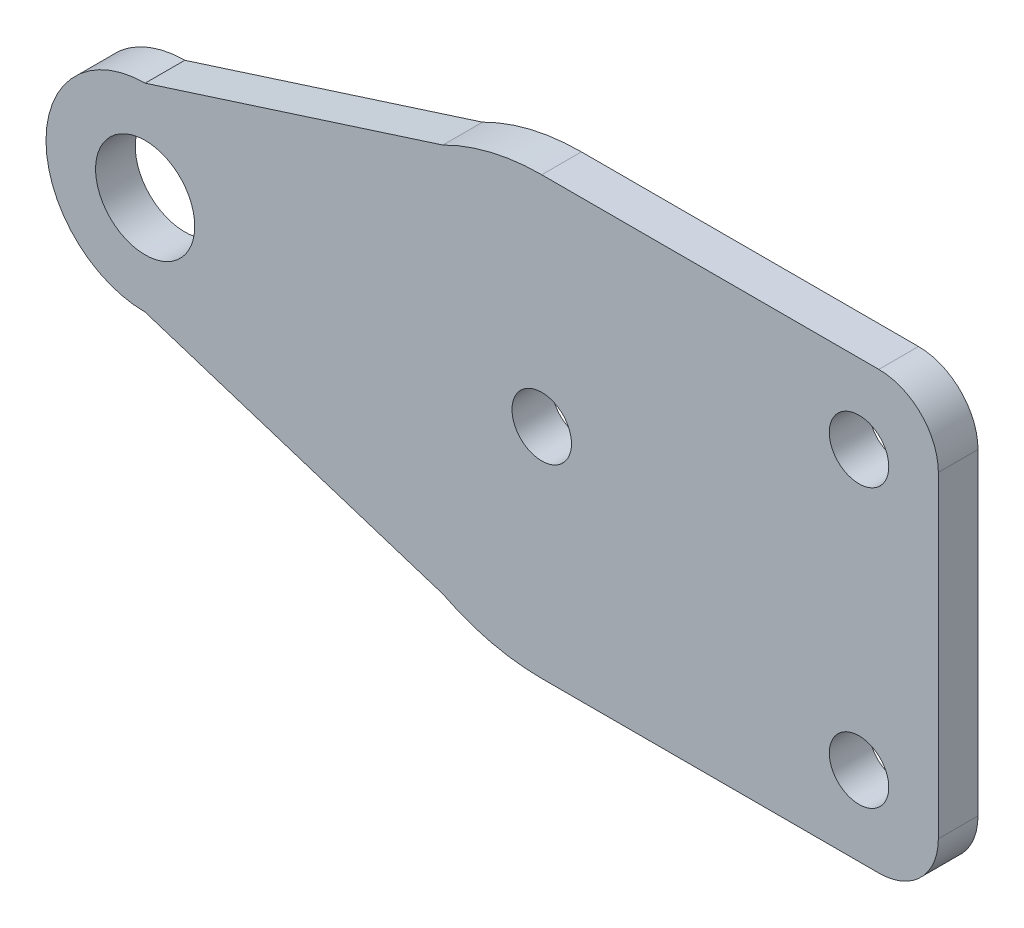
ISO-10303-21;
HEADER;
FILE_DESCRIPTION(('STEP AP214'),'2;1');
FILE_NAME('part.step','',(''),(''),'','','');
FILE_SCHEMA(('AUTOMOTIVE_DESIGN { 1 0 10303 214 1 1 1 1 }'));
ENDSEC;
DATA;
#1=APPLICATION_CONTEXT('core data for automotive mechanical design processes');
#2=APPLICATION_PROTOCOL_DEFINITION('international standard','automotive_design',2000,#1);
#3=PRODUCT_CONTEXT('',#1,'mechanical');
#4=PRODUCT('Part','Part','',(#3));
#5=PRODUCT_RELATED_PRODUCT_CATEGORY('part','',(#4));
#6=PRODUCT_DEFINITION_FORMATION('','',#4);
#7=PRODUCT_DEFINITION_CONTEXT('part definition',#1,'design');
#8=PRODUCT_DEFINITION('design','',#6,#7);
#9=PRODUCT_DEFINITION_SHAPE('','',#8);
#10=(LENGTH_UNIT() NAMED_UNIT(*) SI_UNIT(.MILLI.,.METRE.));
#11=(NAMED_UNIT(*) PLANE_ANGLE_UNIT() SI_UNIT($,.RADIAN.));
#12=(NAMED_UNIT(*) SI_UNIT($,.STERADIAN.) SOLID_ANGLE_UNIT());
#13=UNCERTAINTY_MEASURE_WITH_UNIT(LENGTH_MEASURE(1.E-05),#10,'distance_accuracy_value','');
#14=(GEOMETRIC_REPRESENTATION_CONTEXT(3) GLOBAL_UNCERTAINTY_ASSIGNED_CONTEXT((#13)) GLOBAL_UNIT_ASSIGNED_CONTEXT((#10,
#11,#12)) REPRESENTATION_CONTEXT('',''));
#15=CARTESIAN_POINT('',(0.,0.,0.));
#16=DIRECTION('',(0.,0.,1.));
#17=DIRECTION('',(1.,0.,0.));
#18=AXIS2_PLACEMENT_3D('',#15,#16,#17);
#19=CARTESIAN_POINT('',(0.,-2.72351585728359E-13,2.));
#20=DIRECTION('',(0.,0.,-1.));
#21=DIRECTION('',(-1.,0.,0.));
#22=AXIS2_PLACEMENT_3D('',#19,#20,#21);
#23=PLANE('',#22);
#24=CARTESIAN_POINT('',(16.,-7.,2.));
#25=DIRECTION('',(0.,0.,1.));
#26=DIRECTION('',(-1.,0.,0.));
#27=AXIS2_PLACEMENT_3D('',#24,#25,#26);
#28=CIRCLE('',#27,1.5);
#29=CARTESIAN_POINT('',(14.5,-7.,2.));
#30=VERTEX_POINT('',#29);
#31=EDGE_CURVE('E264',#30,#30,#28,.T.);
#32=ORIENTED_EDGE('',*,*,#31,.F.);
#33=EDGE_LOOP('',(#32));
#34=FACE_BOUND('',#33,.T.);
#35=CARTESIAN_POINT('',(0.,0.,2.));
#36=DIRECTION('',(0.,0.,1.));
#37=DIRECTION('',(1.,0.,0.));
#38=AXIS2_PLACEMENT_3D('',#35,#36,#37);
#39=CIRCLE('',#38,1.5);
#40=CARTESIAN_POINT('',(1.5,0.,2.));
#41=VERTEX_POINT('',#40);
#42=EDGE_CURVE('E122',#41,#41,#39,.T.);
#43=ORIENTED_EDGE('',*,*,#42,.F.);
#44=EDGE_LOOP('',(#43));
#45=FACE_BOUND('',#44,.T.);
#46=CARTESIAN_POINT('',(0.,-2.72351585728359E-13,2.));
#47=DIRECTION('',(0.,0.,1.));
#48=DIRECTION('',(-1.,0.,0.));
#49=AXIS2_PLACEMENT_3D('',#46,#47,#48);
#50=CIRCLE('',#49,11.0000000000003);
#51=CARTESIAN_POINT('',(0.,11.,2.));
#52=VERTEX_POINT('',#51);
#53=CARTESIAN_POINT('',(-4.98792971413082,9.80410919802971,2.));
#54=VERTEX_POINT('',#53);
#55=EDGE_CURVE('E144',#52,#54,#50,.T.);
#56=ORIENTED_EDGE('',*,*,#55,.T.);
#57=DIRECTION('',(-0.952419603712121,-0.304789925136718,0.));
#58=VECTOR('',#57,1.);
#59=CARTESIAN_POINT('',(-20.,5.,2.));
#60=LINE('',#59,#58);
#61=CARTESIAN_POINT('',(-20.,5.,2.));
#62=VERTEX_POINT('',#61);
#63=EDGE_CURVE('E117',#54,#62,#60,.T.);
#64=ORIENTED_EDGE('',*,*,#63,.T.);
#65=CARTESIAN_POINT('',(-20.,0.,2.));
#66=DIRECTION('',(0.,0.,1.));
#67=DIRECTION('',(-1.,0.,0.));
#68=AXIS2_PLACEMENT_3D('',#65,#66,#67);
#69=CIRCLE('',#68,5.);
#70=CARTESIAN_POINT('',(-20.,-5.,2.));
#71=VERTEX_POINT('',#70);
#72=EDGE_CURVE('E147',#62,#71,#69,.T.);
#73=ORIENTED_EDGE('',*,*,#72,.T.);
#74=DIRECTION('',(0.952419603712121,-0.304789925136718,0.));
#75=VECTOR('',#74,1.);
#76=CARTESIAN_POINT('',(-20.,-5.,2.));
#77=LINE('',#76,#75);
#78=CARTESIAN_POINT('',(-4.98792971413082,-9.80410919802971,2.));
#79=VERTEX_POINT('',#78);
#80=EDGE_CURVE('E149',#71,#79,#77,.T.);
#81=ORIENTED_EDGE('',*,*,#80,.T.);
#82=CARTESIAN_POINT('',(0.,0.,2.));
#83=DIRECTION('',(0.,0.,1.));
#84=DIRECTION('',(1.,0.,0.));
#85=AXIS2_PLACEMENT_3D('',#82,#83,#84);
#86=CIRCLE('',#85,11.0000000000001);
#87=CARTESIAN_POINT('',(0.,-11.,2.));
#88=VERTEX_POINT('',#87);
#89=EDGE_CURVE('E151',#79,#88,#86,.T.);
#90=ORIENTED_EDGE('',*,*,#89,.T.);
#91=DIRECTION('',(1.,0.,0.));
#92=VECTOR('',#91,1.);
#93=CARTESIAN_POINT('',(17.,-11.,2.));
#94=LINE('',#93,#92);
#95=CARTESIAN_POINT('',(17.,-11.,2.));
#96=VERTEX_POINT('',#95);
#97=EDGE_CURVE('E153',#88,#96,#94,.T.);
#98=ORIENTED_EDGE('',*,*,#97,.T.);
#99=CARTESIAN_POINT('',(17.,-8.,2.));
#100=DIRECTION('',(0.,0.,1.));
#101=DIRECTION('',(-1.,0.,0.));
#102=AXIS2_PLACEMENT_3D('',#99,#100,#101);
#103=CIRCLE('',#102,3.);
#104=CARTESIAN_POINT('',(20.,-7.99999999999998,2.));
#105=VERTEX_POINT('',#104);
#106=EDGE_CURVE('E155',#96,#105,#103,.T.);
#107=ORIENTED_EDGE('',*,*,#106,.T.);
#108=DIRECTION('',(0.,1.,0.));
#109=VECTOR('',#108,1.);
#110=CARTESIAN_POINT('',(20.,7.99999999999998,2.));
#111=LINE('',#110,#109);
#112=CARTESIAN_POINT('',(20.,7.99999999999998,2.));
#113=VERTEX_POINT('',#112);
#114=EDGE_CURVE('E157',#105,#113,#111,.T.);
#115=ORIENTED_EDGE('',*,*,#114,.T.);
#116=CARTESIAN_POINT('',(17.,8.,2.));
#117=DIRECTION('',(0.,0.,1.));
#118=DIRECTION('',(1.,0.,0.));
#119=AXIS2_PLACEMENT_3D('',#116,#117,#118);
#120=CIRCLE('',#119,3.);
#121=CARTESIAN_POINT('',(17.,11.,2.));
#122=VERTEX_POINT('',#121);
#123=EDGE_CURVE('E46',#113,#122,#120,.T.);
#124=ORIENTED_EDGE('',*,*,#123,.T.);
#125=DIRECTION('',(-1.,0.,0.));
#126=VECTOR('',#125,1.);
#127=CARTESIAN_POINT('',(0.,11.,2.));
#128=LINE('',#127,#126);
#129=EDGE_CURVE('E41',#122,#52,#128,.T.);
#130=ORIENTED_EDGE('',*,*,#129,.T.);
#131=EDGE_LOOP('',(#56,#64,#73,#81,#90,#98,#107,#115,#124,#130));
#132=FACE_BOUND('',#131,.T.);
#133=CARTESIAN_POINT('',(16.,7.,2.));
#134=DIRECTION('',(0.,0.,1.));
#135=DIRECTION('',(1.,0.,0.));
#136=AXIS2_PLACEMENT_3D('',#133,#134,#135);
#137=CIRCLE('',#136,1.5);
#138=CARTESIAN_POINT('',(17.5,7.,2.));
#139=VERTEX_POINT('',#138);
#140=EDGE_CURVE('E270',#139,#139,#137,.T.);
#141=ORIENTED_EDGE('',*,*,#140,.F.);
#142=EDGE_LOOP('',(#141));
#143=FACE_BOUND('',#142,.T.);
#144=CARTESIAN_POINT('',(-20.,0.,2.));
#145=DIRECTION('',(0.,0.,1.));
#146=DIRECTION('',(1.,0.,0.));
#147=AXIS2_PLACEMENT_3D('',#144,#145,#146);
#148=CIRCLE('',#147,2.5);
#149=CARTESIAN_POINT('',(-17.5,0.,2.));
#150=VERTEX_POINT('',#149);
#151=EDGE_CURVE('E253',#150,#150,#148,.T.);
#152=ORIENTED_EDGE('',*,*,#151,.F.);
#153=EDGE_LOOP('',(#152));
#154=FACE_BOUND('',#153,.T.);
#155=ADVANCED_FACE('F26',(#34,#45,#132,#143,#154),#23,.F.);
#156=CARTESIAN_POINT('',(0.,-2.72351585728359E-13,0.));
#157=DIRECTION('',(0.,0.,-1.));
#158=DIRECTION('',(-1.,0.,0.));
#159=AXIS2_PLACEMENT_3D('',#156,#157,#158);
#160=PLANE('',#159);
#161=CARTESIAN_POINT('',(16.,-7.,0.));
#162=DIRECTION('',(0.,0.,1.));
#163=DIRECTION('',(-1.,0.,0.));
#164=AXIS2_PLACEMENT_3D('',#161,#162,#163);
#165=CIRCLE('',#164,1.5);
#166=CARTESIAN_POINT('',(14.5,-7.,0.));
#167=VERTEX_POINT('',#166);
#168=EDGE_CURVE('E259',#167,#167,#165,.T.);
#169=ORIENTED_EDGE('',*,*,#168,.T.);
#170=EDGE_LOOP('',(#169));
#171=FACE_BOUND('',#170,.T.);
#172=CARTESIAN_POINT('',(0.,0.,0.));
#173=DIRECTION('',(0.,0.,1.));
#174=DIRECTION('',(1.,0.,0.));
#175=AXIS2_PLACEMENT_3D('',#172,#173,#174);
#176=CIRCLE('',#175,1.5);
#177=CARTESIAN_POINT('',(1.5,0.,0.));
#178=VERTEX_POINT('',#177);
#179=EDGE_CURVE('E125',#178,#178,#176,.T.);
#180=ORIENTED_EDGE('',*,*,#179,.T.);
#181=EDGE_LOOP('',(#180));
#182=FACE_BOUND('',#181,.T.);
#183=CARTESIAN_POINT('',(0.,-2.72351585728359E-13,0.));
#184=DIRECTION('',(0.,0.,1.));
#185=DIRECTION('',(-1.,0.,0.));
#186=AXIS2_PLACEMENT_3D('',#183,#184,#185);
#187=CIRCLE('',#186,11.0000000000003);
#188=CARTESIAN_POINT('',(0.,11.,0.));
#189=VERTEX_POINT('',#188);
#190=CARTESIAN_POINT('',(-4.98792971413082,9.80410919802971,0.));
#191=VERTEX_POINT('',#190);
#192=EDGE_CURVE('E108',#189,#191,#187,.T.);
#193=ORIENTED_EDGE('',*,*,#192,.F.);
#194=DIRECTION('',(-1.,0.,0.));
#195=VECTOR('',#194,1.);
#196=CARTESIAN_POINT('',(0.,11.,0.));
#197=LINE('',#196,#195);
#198=CARTESIAN_POINT('',(17.,11.,0.));
#199=VERTEX_POINT('',#198);
#200=EDGE_CURVE('E142',#199,#189,#197,.T.);
#201=ORIENTED_EDGE('',*,*,#200,.F.);
#202=CARTESIAN_POINT('',(17.,8.,0.));
#203=DIRECTION('',(0.,0.,1.));
#204=DIRECTION('',(1.,0.,0.));
#205=AXIS2_PLACEMENT_3D('',#202,#203,#204);
#206=CIRCLE('',#205,3.);
#207=CARTESIAN_POINT('',(20.,7.99999999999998,0.));
#208=VERTEX_POINT('',#207);
#209=EDGE_CURVE('E140',#208,#199,#206,.T.);
#210=ORIENTED_EDGE('',*,*,#209,.F.);
#211=DIRECTION('',(0.,1.,0.));
#212=VECTOR('',#211,1.);
#213=CARTESIAN_POINT('',(20.,7.99999999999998,0.));
#214=LINE('',#213,#212);
#215=CARTESIAN_POINT('',(20.,-7.99999999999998,0.));
#216=VERTEX_POINT('',#215);
#217=EDGE_CURVE('E138',#216,#208,#214,.T.);
#218=ORIENTED_EDGE('',*,*,#217,.F.);
#219=CARTESIAN_POINT('',(17.,-8.,0.));
#220=DIRECTION('',(0.,0.,1.));
#221=DIRECTION('',(-1.,0.,0.));
#222=AXIS2_PLACEMENT_3D('',#219,#220,#221);
#223=CIRCLE('',#222,3.);
#224=CARTESIAN_POINT('',(17.,-11.,0.));
#225=VERTEX_POINT('',#224);
#226=EDGE_CURVE('E136',#225,#216,#223,.T.);
#227=ORIENTED_EDGE('',*,*,#226,.F.);
#228=DIRECTION('',(1.,0.,0.));
#229=VECTOR('',#228,1.);
#230=CARTESIAN_POINT('',(17.,-11.,0.));
#231=LINE('',#230,#229);
#232=CARTESIAN_POINT('',(0.,-11.,0.));
#233=VERTEX_POINT('',#232);
#234=EDGE_CURVE('E134',#233,#225,#231,.T.);
#235=ORIENTED_EDGE('',*,*,#234,.F.);
#236=CARTESIAN_POINT('',(0.,0.,0.));
#237=DIRECTION('',(0.,0.,1.));
#238=DIRECTION('',(1.,0.,0.));
#239=AXIS2_PLACEMENT_3D('',#236,#237,#238);
#240=CIRCLE('',#239,11.0000000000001);
#241=CARTESIAN_POINT('',(-4.98792971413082,-9.80410919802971,0.));
#242=VERTEX_POINT('',#241);
#243=EDGE_CURVE('E132',#242,#233,#240,.T.);
#244=ORIENTED_EDGE('',*,*,#243,.F.);
#245=DIRECTION('',(0.952419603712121,-0.304789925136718,0.));
#246=VECTOR('',#245,1.);
#247=CARTESIAN_POINT('',(-20.,-5.,0.));
#248=LINE('',#247,#246);
#249=CARTESIAN_POINT('',(-20.,-5.,0.));
#250=VERTEX_POINT('',#249);
#251=EDGE_CURVE('E130',#250,#242,#248,.T.);
#252=ORIENTED_EDGE('',*,*,#251,.F.);
#253=CARTESIAN_POINT('',(-20.,0.,0.));
#254=DIRECTION('',(0.,0.,1.));
#255=DIRECTION('',(-1.,0.,0.));
#256=AXIS2_PLACEMENT_3D('',#253,#254,#255);
#257=CIRCLE('',#256,5.);
#258=CARTESIAN_POINT('',(-20.,5.,0.));
#259=VERTEX_POINT('',#258);
#260=EDGE_CURVE('E110',#259,#250,#257,.T.);
#261=ORIENTED_EDGE('',*,*,#260,.F.);
#262=DIRECTION('',(-0.952419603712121,-0.304789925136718,0.));
#263=VECTOR('',#262,1.);
#264=CARTESIAN_POINT('',(-20.,5.,0.));
#265=LINE('',#264,#263);
#266=EDGE_CURVE('E103',#191,#259,#265,.T.);
#267=ORIENTED_EDGE('',*,*,#266,.F.);
#268=EDGE_LOOP('',(#193,#201,#210,#218,#227,#235,#244,#252,#261,#267));
#269=FACE_BOUND('',#268,.T.);
#270=CARTESIAN_POINT('',(16.,7.,0.));
#271=DIRECTION('',(0.,0.,1.));
#272=DIRECTION('',(1.,0.,0.));
#273=AXIS2_PLACEMENT_3D('',#270,#271,#272);
#274=CIRCLE('',#273,1.5);
#275=CARTESIAN_POINT('',(17.5,7.,0.));
#276=VERTEX_POINT('',#275);
#277=EDGE_CURVE('E267',#276,#276,#274,.T.);
#278=ORIENTED_EDGE('',*,*,#277,.T.);
#279=EDGE_LOOP('',(#278));
#280=FACE_BOUND('',#279,.T.);
#281=CARTESIAN_POINT('',(-20.,0.,0.));
#282=DIRECTION('',(0.,0.,1.));
#283=DIRECTION('',(1.,0.,0.));
#284=AXIS2_PLACEMENT_3D('',#281,#282,#283);
#285=CIRCLE('',#284,2.5);
#286=CARTESIAN_POINT('',(-17.5,0.,0.));
#287=VERTEX_POINT('',#286);
#288=EDGE_CURVE('E256',#287,#287,#285,.T.);
#289=ORIENTED_EDGE('',*,*,#288,.T.);
#290=EDGE_LOOP('',(#289));
#291=FACE_BOUND('',#290,.T.);
#292=ADVANCED_FACE('F104',(#171,#182,#269,#280,#291),#160,.T.);
#293=CARTESIAN_POINT('',(0.,-2.72351585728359E-13,2.));
#294=DIRECTION('',(0.,0.,-1.));
#295=DIRECTION('',(-1.,0.,0.));
#296=AXIS2_PLACEMENT_3D('',#293,#294,#295);
#297=CYLINDRICAL_SURFACE('',#296,11.0000000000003);
#298=ORIENTED_EDGE('',*,*,#192,.T.);
#299=DIRECTION('',(0.,0.,-1.));
#300=VECTOR('',#299,1.);
#301=CARTESIAN_POINT('',(-4.98792971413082,9.80410919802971,2.));
#302=LINE('',#301,#300);
#303=EDGE_CURVE('E11',#54,#191,#302,.T.);
#304=ORIENTED_EDGE('',*,*,#303,.F.);
#305=ORIENTED_EDGE('',*,*,#55,.F.);
#306=DIRECTION('',(0.,0.,-1.));
#307=VECTOR('',#306,1.);
#308=CARTESIAN_POINT('',(0.,11.,2.));
#309=LINE('',#308,#307);
#310=EDGE_CURVE('E121',#52,#189,#309,.T.);
#311=ORIENTED_EDGE('',*,*,#310,.T.);
#312=EDGE_LOOP('',(#298,#304,#305,#311));
#313=FACE_BOUND('',#312,.T.);
#314=ADVANCED_FACE('F28',(#313),#297,.T.);
#315=CARTESIAN_POINT('',(-20.,5.,2.));
#316=DIRECTION('',(0.304789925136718,-0.952419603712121,0.));
#317=DIRECTION('',(0.952419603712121,0.304789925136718,0.));
#318=AXIS2_PLACEMENT_3D('',#315,#316,#317);
#319=PLANE('',#318);
#320=ORIENTED_EDGE('',*,*,#266,.T.);
#321=DIRECTION('',(0.,0.,-1.));
#322=VECTOR('',#321,1.);
#323=CARTESIAN_POINT('',(-20.,5.,2.));
#324=LINE('',#323,#322);
#325=EDGE_CURVE('E34',#62,#259,#324,.T.);
#326=ORIENTED_EDGE('',*,*,#325,.F.);
#327=ORIENTED_EDGE('',*,*,#63,.F.);
#328=ORIENTED_EDGE('',*,*,#303,.T.);
#329=EDGE_LOOP('',(#320,#326,#327,#328));
#330=FACE_BOUND('',#329,.T.);
#331=ADVANCED_FACE('F116',(#330),#319,.F.);
#332=CARTESIAN_POINT('',(-20.,0.,2.));
#333=DIRECTION('',(0.,0.,-1.));
#334=DIRECTION('',(-1.,0.,0.));
#335=AXIS2_PLACEMENT_3D('',#332,#333,#334);
#336=CYLINDRICAL_SURFACE('',#335,5.);
#337=ORIENTED_EDGE('',*,*,#260,.T.);
#338=DIRECTION('',(0.,0.,-1.));
#339=VECTOR('',#338,1.);
#340=CARTESIAN_POINT('',(-20.,-5.,2.));
#341=LINE('',#340,#339);
#342=EDGE_CURVE('E180',#71,#250,#341,.T.);
#343=ORIENTED_EDGE('',*,*,#342,.F.);
#344=ORIENTED_EDGE('',*,*,#72,.F.);
#345=ORIENTED_EDGE('',*,*,#325,.T.);
#346=EDGE_LOOP('',(#337,#343,#344,#345));
#347=FACE_BOUND('',#346,.T.);
#348=ADVANCED_FACE('F184',(#347),#336,.T.);
#349=CARTESIAN_POINT('',(-20.,-5.,2.));
#350=DIRECTION('',(0.304789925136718,0.952419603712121,0.));
#351=DIRECTION('',(-0.952419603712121,0.304789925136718,0.));
#352=AXIS2_PLACEMENT_3D('',#349,#350,#351);
#353=PLANE('',#352);
#354=ORIENTED_EDGE('',*,*,#251,.T.);
#355=DIRECTION('',(0.,0.,-1.));
#356=VECTOR('',#355,1.);
#357=CARTESIAN_POINT('',(-4.98792971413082,-9.80410919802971,2.));
#358=LINE('',#357,#356);
#359=EDGE_CURVE('E177',#79,#242,#358,.T.);
#360=ORIENTED_EDGE('',*,*,#359,.F.);
#361=ORIENTED_EDGE('',*,*,#80,.F.);
#362=ORIENTED_EDGE('',*,*,#342,.T.);
#363=EDGE_LOOP('',(#354,#360,#361,#362));
#364=FACE_BOUND('',#363,.T.);
#365=ADVANCED_FACE('F192',(#364),#353,.F.);
#366=CARTESIAN_POINT('',(0.,0.,2.));
#367=DIRECTION('',(0.,0.,-1.));
#368=DIRECTION('',(-1.,0.,0.));
#369=AXIS2_PLACEMENT_3D('',#366,#367,#368);
#370=CYLINDRICAL_SURFACE('',#369,11.0000000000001);
#371=ORIENTED_EDGE('',*,*,#243,.T.);
#372=DIRECTION('',(0.,0.,-1.));
#373=VECTOR('',#372,1.);
#374=CARTESIAN_POINT('',(0.,-11.,2.));
#375=LINE('',#374,#373);
#376=EDGE_CURVE('E174',#88,#233,#375,.T.);
#377=ORIENTED_EDGE('',*,*,#376,.F.);
#378=ORIENTED_EDGE('',*,*,#89,.F.);
#379=ORIENTED_EDGE('',*,*,#359,.T.);
#380=EDGE_LOOP('',(#371,#377,#378,#379));
#381=FACE_BOUND('',#380,.T.);
#382=ADVANCED_FACE('F195',(#381),#370,.T.);
#383=CARTESIAN_POINT('',(17.,-11.,2.));
#384=DIRECTION('',(0.,1.,0.));
#385=DIRECTION('',(0.,0.,1.));
#386=AXIS2_PLACEMENT_3D('',#383,#384,#385);
#387=PLANE('',#386);
#388=ORIENTED_EDGE('',*,*,#234,.T.);
#389=DIRECTION('',(0.,0.,-1.));
#390=VECTOR('',#389,1.);
#391=CARTESIAN_POINT('',(17.,-11.,2.));
#392=LINE('',#391,#390);
#393=EDGE_CURVE('E171',#96,#225,#392,.T.);
#394=ORIENTED_EDGE('',*,*,#393,.F.);
#395=ORIENTED_EDGE('',*,*,#97,.F.);
#396=ORIENTED_EDGE('',*,*,#376,.T.);
#397=EDGE_LOOP('',(#388,#394,#395,#396));
#398=FACE_BOUND('',#397,.T.);
#399=ADVANCED_FACE('F200',(#398),#387,.F.);
#400=CARTESIAN_POINT('',(17.,-8.,2.));
#401=DIRECTION('',(0.,0.,-1.));
#402=DIRECTION('',(-1.,0.,0.));
#403=AXIS2_PLACEMENT_3D('',#400,#401,#402);
#404=CYLINDRICAL_SURFACE('',#403,3.);
#405=ORIENTED_EDGE('',*,*,#226,.T.);
#406=DIRECTION('',(0.,0.,-1.));
#407=VECTOR('',#406,1.);
#408=CARTESIAN_POINT('',(20.,-7.99999999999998,2.));
#409=LINE('',#408,#407);
#410=EDGE_CURVE('E168',#105,#216,#409,.T.);
#411=ORIENTED_EDGE('',*,*,#410,.F.);
#412=ORIENTED_EDGE('',*,*,#106,.F.);
#413=ORIENTED_EDGE('',*,*,#393,.T.);
#414=EDGE_LOOP('',(#405,#411,#412,#413));
#415=FACE_BOUND('',#414,.T.);
#416=ADVANCED_FACE('F206',(#415),#404,.T.);
#417=CARTESIAN_POINT('',(20.,7.99999999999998,2.));
#418=DIRECTION('',(-1.,0.,0.));
#419=DIRECTION('',(0.,0.,1.));
#420=AXIS2_PLACEMENT_3D('',#417,#418,#419);
#421=PLANE('',#420);
#422=ORIENTED_EDGE('',*,*,#217,.T.);
#423=DIRECTION('',(0.,0.,-1.));
#424=VECTOR('',#423,1.);
#425=CARTESIAN_POINT('',(20.,7.99999999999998,2.));
#426=LINE('',#425,#424);
#427=EDGE_CURVE('E165',#113,#208,#426,.T.);
#428=ORIENTED_EDGE('',*,*,#427,.F.);
#429=ORIENTED_EDGE('',*,*,#114,.F.);
#430=ORIENTED_EDGE('',*,*,#410,.T.);
#431=EDGE_LOOP('',(#422,#428,#429,#430));
#432=FACE_BOUND('',#431,.T.);
#433=ADVANCED_FACE('F210',(#432),#421,.F.);
#434=CARTESIAN_POINT('',(17.,8.,2.));
#435=DIRECTION('',(0.,0.,-1.));
#436=DIRECTION('',(-1.,0.,0.));
#437=AXIS2_PLACEMENT_3D('',#434,#435,#436);
#438=CYLINDRICAL_SURFACE('',#437,3.);
#439=ORIENTED_EDGE('',*,*,#209,.T.);
#440=DIRECTION('',(0.,0.,-1.));
#441=VECTOR('',#440,1.);
#442=CARTESIAN_POINT('',(17.,11.,2.));
#443=LINE('',#442,#441);
#444=EDGE_CURVE('E162',#122,#199,#443,.T.);
#445=ORIENTED_EDGE('',*,*,#444,.F.);
#446=ORIENTED_EDGE('',*,*,#123,.F.);
#447=ORIENTED_EDGE('',*,*,#427,.T.);
#448=EDGE_LOOP('',(#439,#445,#446,#447));
#449=FACE_BOUND('',#448,.T.);
#450=ADVANCED_FACE('F213',(#449),#438,.T.);
#451=CARTESIAN_POINT('',(0.,11.,2.));
#452=DIRECTION('',(0.,-1.,0.));
#453=DIRECTION('',(0.,0.,-1.));
#454=AXIS2_PLACEMENT_3D('',#451,#452,#453);
#455=PLANE('',#454);
#456=ORIENTED_EDGE('',*,*,#200,.T.);
#457=ORIENTED_EDGE('',*,*,#310,.F.);
#458=ORIENTED_EDGE('',*,*,#129,.F.);
#459=ORIENTED_EDGE('',*,*,#444,.T.);
#460=EDGE_LOOP('',(#456,#457,#458,#459));
#461=FACE_BOUND('',#460,.T.);
#462=ADVANCED_FACE('F215',(#461),#455,.F.);
#463=CARTESIAN_POINT('',(0.,0.,2.));
#464=DIRECTION('',(0.,0.,-1.));
#465=DIRECTION('',(-1.,0.,0.));
#466=AXIS2_PLACEMENT_3D('',#463,#464,#465);
#467=CYLINDRICAL_SURFACE('',#466,1.5);
#468=ORIENTED_EDGE('',*,*,#42,.T.);
#469=EDGE_LOOP('',(#468));
#470=FACE_BOUND('',#469,.T.);
#471=ORIENTED_EDGE('',*,*,#179,.F.);
#472=EDGE_LOOP('',(#471));
#473=FACE_BOUND('',#472,.T.);
#474=ADVANCED_FACE('F217',(#470,#473),#467,.F.);
#475=CARTESIAN_POINT('',(16.,7.,2.));
#476=DIRECTION('',(0.,0.,-1.));
#477=DIRECTION('',(-1.,0.,0.));
#478=AXIS2_PLACEMENT_3D('',#475,#476,#477);
#479=CYLINDRICAL_SURFACE('',#478,1.5);
#480=ORIENTED_EDGE('',*,*,#140,.T.);
#481=EDGE_LOOP('',(#480));
#482=FACE_BOUND('',#481,.T.);
#483=ORIENTED_EDGE('',*,*,#277,.F.);
#484=EDGE_LOOP('',(#483));
#485=FACE_BOUND('',#484,.T.);
#486=ADVANCED_FACE('F223',(#482,#485),#479,.F.);
#487=CARTESIAN_POINT('',(16.,-7.,2.));
#488=DIRECTION('',(0.,0.,-1.));
#489=DIRECTION('',(-1.,0.,0.));
#490=AXIS2_PLACEMENT_3D('',#487,#488,#489);
#491=CYLINDRICAL_SURFACE('',#490,1.5);
#492=ORIENTED_EDGE('',*,*,#31,.T.);
#493=EDGE_LOOP('',(#492));
#494=FACE_BOUND('',#493,.T.);
#495=ORIENTED_EDGE('',*,*,#168,.F.);
#496=EDGE_LOOP('',(#495));
#497=FACE_BOUND('',#496,.T.);
#498=ADVANCED_FACE('F240',(#494,#497),#491,.F.);
#499=CARTESIAN_POINT('',(-20.,0.,2.));
#500=DIRECTION('',(0.,0.,-1.));
#501=DIRECTION('',(-1.,0.,0.));
#502=AXIS2_PLACEMENT_3D('',#499,#500,#501);
#503=CYLINDRICAL_SURFACE('',#502,2.5);
#504=ORIENTED_EDGE('',*,*,#151,.T.);
#505=EDGE_LOOP('',(#504));
#506=FACE_BOUND('',#505,.T.);
#507=ORIENTED_EDGE('',*,*,#288,.F.);
#508=EDGE_LOOP('',(#507));
#509=FACE_BOUND('',#508,.T.);
#510=ADVANCED_FACE('F244',(#506,#509),#503,.F.);
#511=CLOSED_SHELL('',(#155,#292,#314,#331,#348,#365,#382,#399,#416,#433,#450,#462,#474,#486,
#498,#510));
#512=MANIFOLD_SOLID_BREP('B2',#511);
#513=ADVANCED_BREP_SHAPE_REPRESENTATION('',(#18,#512),#14);
#514=SHAPE_DEFINITION_REPRESENTATION(#9,#513);
ENDSEC;
END-ISO-10303-21;
